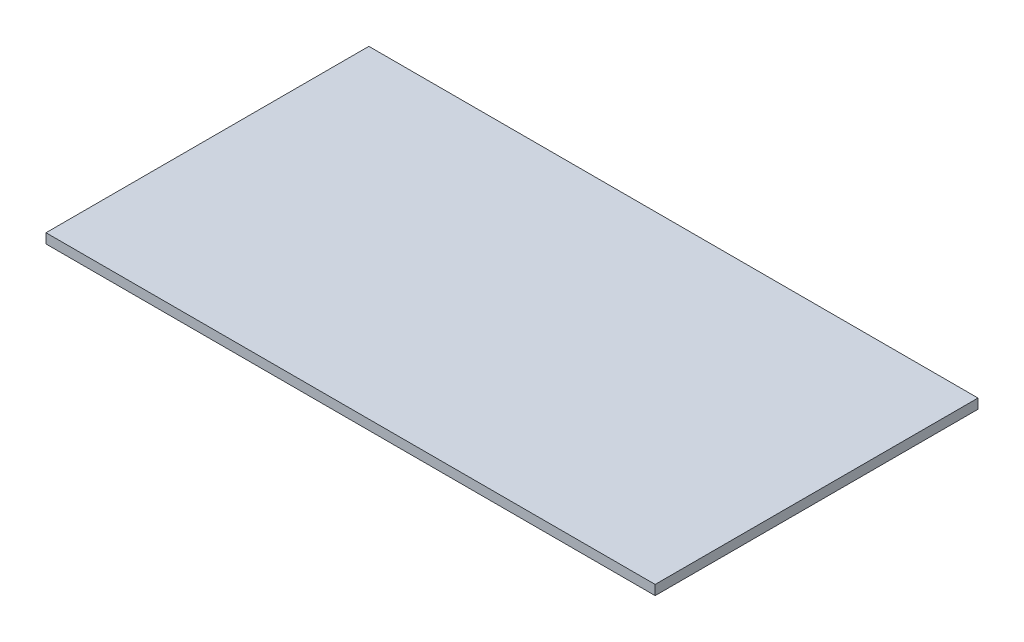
from build123d import *

# Parameters (mm, degrees)
SKETCH1_W           = 1000
SKETCH1_H           = 530
BOSS_EXTRUDE1_DEPTH = 16


with BuildPart() as part:
    # Sketch1 → Boss-Extrude1 (new body)
    with BuildSketch(Plane(origin=(0, 0, 0), x_dir=(1, 0, 0), z_dir=(0, 1, 0))):
        Rectangle(SKETCH1_W, SKETCH1_H)
    extrude(amount=BOSS_EXTRUDE1_DEPTH)


solid = part.part
